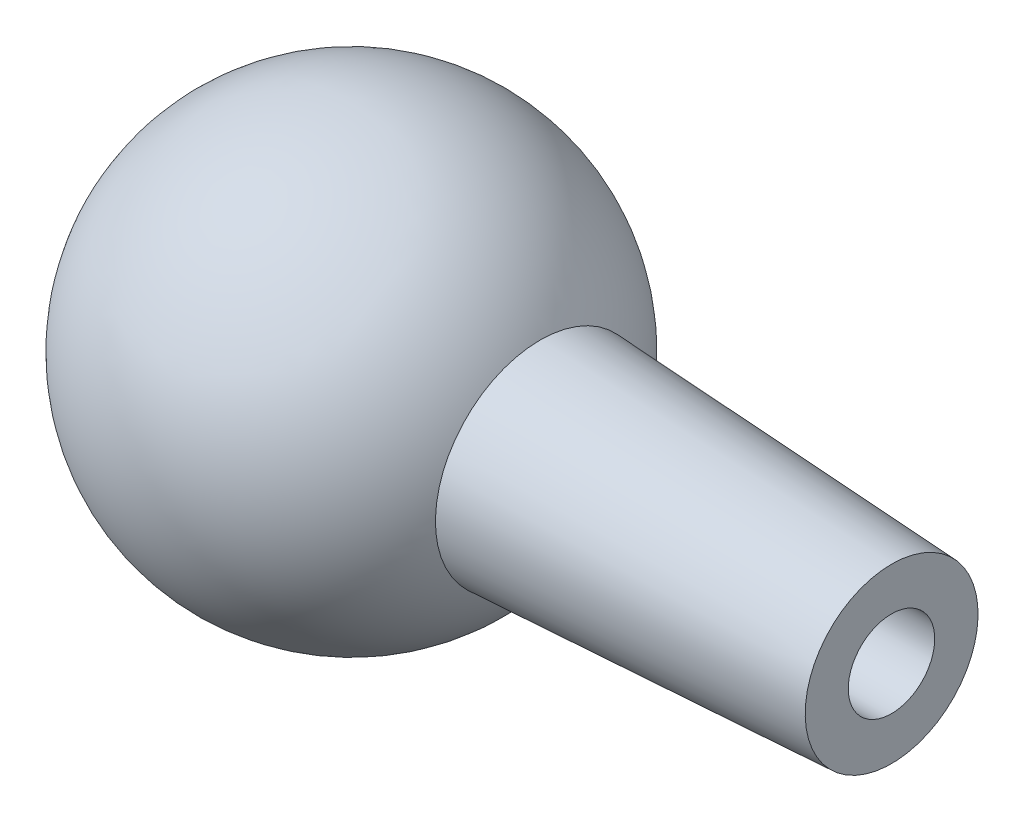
from build123d import *


with BuildPart() as part:
    # Sketch1 → Revolve1 (revolve)
    with BuildSketch(Plane.XY):
        with BuildLine():
            Line((0, 1.27), (-20.274409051, 1.27))
            ThreePointArc((-20.274409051, 1.27), (-21.374261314, 1.905), (-21.374261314, 3.175))
            ThreePointArc((-21.374261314, 3.175), (-15.821101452, 6.349771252), (-10.322634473, 3.081190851))
            Line((-10.322634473, 3.081190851), (0.004023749, 2.539993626))
            Line((0.004023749, 2.539993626), (0, 1.27))
        make_face()
    revolve(axis=Axis((0, 0, 0), (-1, 0, 0)))


solid = part.part
